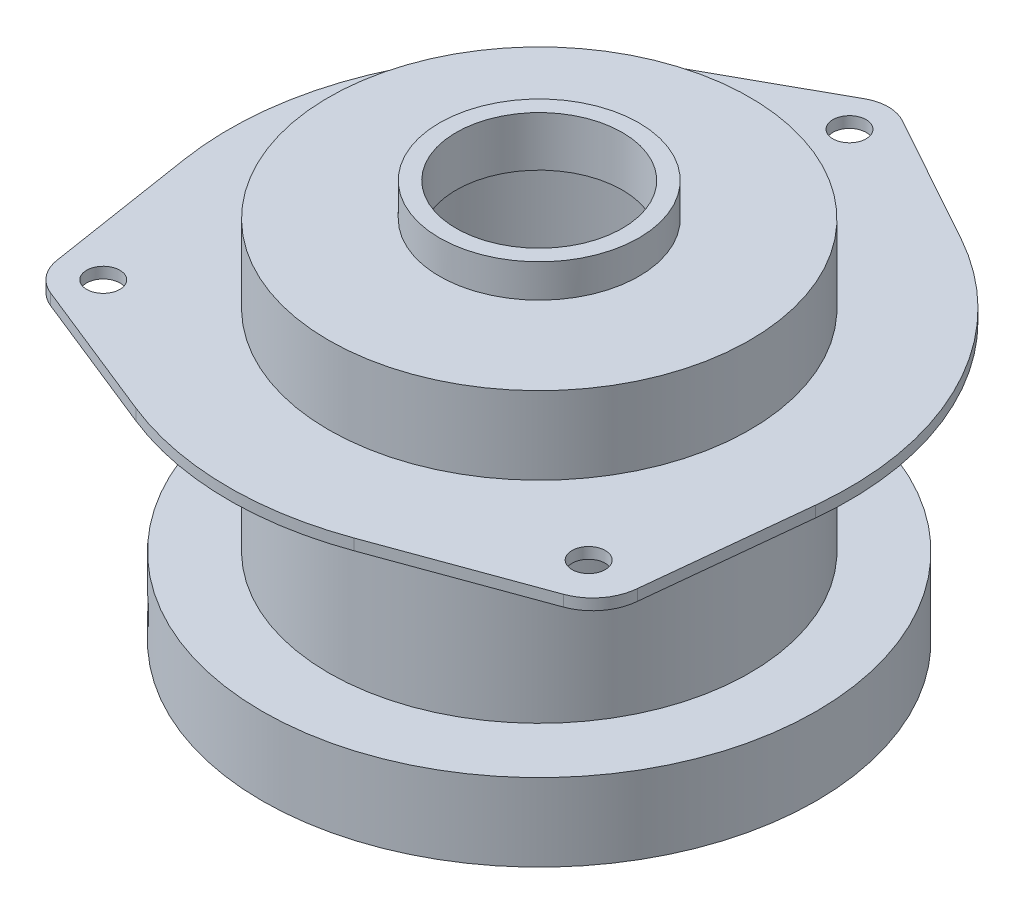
from build123d import *

# Parameters (mm, degrees)
ESQUISSE1_R             = 9
EXTRUSION1_DEPTH        = 3
ESQUISSE2_R             = 19
EXTRUSION2_DEPTH        = 26
ESQUISSE4_R             = 25
EXTRUSION3_DEPTH        = 7
COQUE2_T                = -1.5
ESQUISSE5_R             = 7.5
ENL_V_MAT_EXTRU_2_DEPTH = 50.398886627
ESQUISSE6_R             = 1.5
ESQUISSE6_R_2           = 19
EXTRUSION4_DEPTH        = 1
ESQUISSE7_W             = 38
ESQUISSE7_H             = 1.846303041
ENL_V_MAT_EXTRU_3_DEPTH = 54.528030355


with BuildPart() as part:
    # Esquisse1 → Extrusion1 (new body)
    with BuildSketch(Plane(origin=(0, 0, 0), x_dir=(1, 0, 0), z_dir=(0, 1, 0))):
        with Locations(Location((0, 0, 0), (0, 0, 270))):
            Circle(ESQUISSE1_R)
    extrude(amount=EXTRUSION1_DEPTH)

    # Esquisse2 → Extrusion2 (add)
    with BuildSketch(Plane.XZ):
        with Locations(Location((0, 0, 0), (0, 0, 90))):
            Circle(ESQUISSE2_R)
    extrude(amount=EXTRUSION2_DEPTH)

    # Esquisse4 → Extrusion3 (add)
    with BuildSketch(Plane.XZ.offset(26)):
        with Locations(Location((0, 0, 0), (0, 0, 270))):
            Circle(ESQUISSE4_R)
    extrude(amount=EXTRUSION3_DEPTH)

    # Coque2
    coque2_openings = [part.faces().sort_by_distance(p)[0] for p in [
        (0, -33, 0),
    ]]
    offset(amount=COQUE2_T, openings=coque2_openings, kind=Kind.INTERSECTION)

    # Esquisse5 → Enl_v. mat.-Extru.2 (cut, through all)
    with BuildSketch(Plane.XZ.offset(-1.5)):
        with Locations(Location((0, 0, 0), (0, 0, 270))):
            Circle(ESQUISSE5_R)
    extrude(amount=-ENL_V_MAT_EXTRU_2_DEPTH, mode=Mode.SUBTRACT)

    # Esquisse6 → Extrusion4 (add)
    with BuildSketch(Plane(origin=(0, -7, 0), x_dir=(-1, 0, 0), z_dir=(0, 1, 0))):
        with BuildLine():
            Line((1.694430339, -31.062500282), (13.555441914, -24.500000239))
            ThreePointArc((13.555441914, -24.500000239), (25.171942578, -12.262680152), (27.647718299, 4.427605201))
            Line((27.647718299, 4.427605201), (25.519438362, 18.008477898))
            ThreePointArc((25.519438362, 18.008477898), (24.766803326, 19.721559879), (23.265775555, 20.838710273))
            Line((23.265775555, 20.838710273), (10.419677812, 25.989042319))
            ThreePointArc((10.419677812, 25.989042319), (0.440872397, 27.996528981), (-9.596194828, 26.304240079))
            Line((-9.596194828, 26.304240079), (-23.435083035, 21.255598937))
            ThreePointArc((-23.435083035, 21.255598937), (-25.443637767, 19.774177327), (-26.332061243, 17.441881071))
            Line((-26.332061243, 17.441881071), (-27.848806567, 2.905851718))
            ThreePointArc((-27.848806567, 2.905851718), (-24.826359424, -12.948045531), (-13.555441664, -24.500000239))
            Line((-13.555441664, -24.500000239), (-1.694430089, -31.062500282))
            ThreePointArc((-1.694430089, -31.062500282), (1.25e-07, -31.500000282), (1.694430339, -31.062500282))
        make_face()
        with Locations(Location((0, -28, 0), (0, 0, 90))):
            Circle(ESQUISSE6_R, mode=Mode.SUBTRACT)
        with Locations(Location((21.903898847, 17.441881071, 0), (0, 0, 270))):
            Circle(ESQUISSE6_R, mode=Mode.SUBTRACT)
        with Locations(Location((-21.903898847, 17.441881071, 0), (0, 0, 90))):
            Circle(ESQUISSE6_R, mode=Mode.SUBTRACT)
        with Locations(Location((0, 0, 0), (0, 0, 90))):
            Circle(ESQUISSE6_R_2, mode=Mode.SUBTRACT)
    extrude(amount=-EXTRUSION4_DEPTH)

    # Esquisse7 → Enl_v. mat.-Extru.3 (cut, through all)
    with BuildSketch(Plane(origin=(0, 0, 0), x_dir=(0, 0, -1), z_dir=(1, 0, 0))):
        with Locations((0, -30.039676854)):
            Rectangle(ESQUISSE7_W, ESQUISSE7_H)
    extrude(amount=-ENL_V_MAT_EXTRU_3_DEPTH, mode=Mode.SUBTRACT)


solid = part.part
